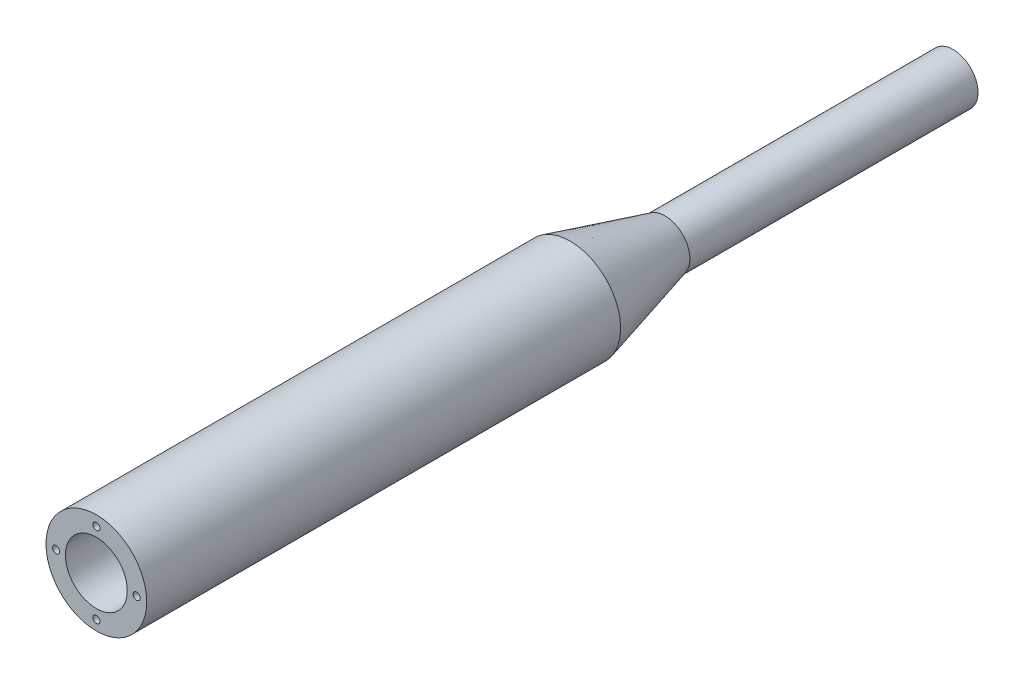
ISO-10303-21;
HEADER;
FILE_DESCRIPTION(('STEP AP214'),'2;1');
FILE_NAME('part.step','',(''),(''),'','','');
FILE_SCHEMA(('AUTOMOTIVE_DESIGN { 1 0 10303 214 1 1 1 1 }'));
ENDSEC;
DATA;
#1=APPLICATION_CONTEXT('core data for automotive mechanical design processes');
#2=APPLICATION_PROTOCOL_DEFINITION('international standard','automotive_design',2000,#1);
#3=PRODUCT_CONTEXT('',#1,'mechanical');
#4=PRODUCT('Part','Part','',(#3));
#5=PRODUCT_RELATED_PRODUCT_CATEGORY('part','',(#4));
#6=PRODUCT_DEFINITION_FORMATION('','',#4);
#7=PRODUCT_DEFINITION_CONTEXT('part definition',#1,'design');
#8=PRODUCT_DEFINITION('design','',#6,#7);
#9=PRODUCT_DEFINITION_SHAPE('','',#8);
#10=(LENGTH_UNIT() NAMED_UNIT(*) SI_UNIT(.MILLI.,.METRE.));
#11=(NAMED_UNIT(*) PLANE_ANGLE_UNIT() SI_UNIT($,.RADIAN.));
#12=(NAMED_UNIT(*) SI_UNIT($,.STERADIAN.) SOLID_ANGLE_UNIT());
#13=UNCERTAINTY_MEASURE_WITH_UNIT(LENGTH_MEASURE(1.E-05),#10,'distance_accuracy_value','');
#14=(GEOMETRIC_REPRESENTATION_CONTEXT(3) GLOBAL_UNCERTAINTY_ASSIGNED_CONTEXT((#13)) GLOBAL_UNIT_ASSIGNED_CONTEXT((#10,
#11,#12)) REPRESENTATION_CONTEXT('',''));
#15=CARTESIAN_POINT('',(0.,0.,0.));
#16=DIRECTION('',(0.,0.,1.));
#17=DIRECTION('',(1.,0.,0.));
#18=AXIS2_PLACEMENT_3D('',#15,#16,#17);
#19=CARTESIAN_POINT('',(0.,0.,254.));
#20=DIRECTION('',(0.,0.,1.));
#21=DIRECTION('',(1.,0.,0.));
#22=AXIS2_PLACEMENT_3D('',#19,#20,#21);
#23=CYLINDRICAL_SURFACE('',#22,15.875);
#24=CARTESIAN_POINT('',(0.,0.,0.));
#25=DIRECTION('',(0.,0.,1.));
#26=DIRECTION('',(1.,0.,0.));
#27=AXIS2_PLACEMENT_3D('',#24,#25,#26);
#28=CIRCLE('',#27,15.875);
#29=CARTESIAN_POINT('',(15.875,0.,0.));
#30=VERTEX_POINT('',#29);
#31=EDGE_CURVE('E98',#30,#30,#28,.T.);
#32=ORIENTED_EDGE('',*,*,#31,.F.);
#33=EDGE_LOOP('',(#32));
#34=FACE_BOUND('',#33,.T.);
#35=CARTESIAN_POINT('',(0.,0.,228.6));
#36=DIRECTION('',(0.,0.,1.));
#37=DIRECTION('',(1.,0.,0.));
#38=AXIS2_PLACEMENT_3D('',#35,#36,#37);
#39=CIRCLE('',#38,15.875);
#40=CARTESIAN_POINT('',(15.875,0.,228.6));
#41=VERTEX_POINT('',#40);
#42=EDGE_CURVE('E40',#41,#41,#39,.F.);
#43=ORIENTED_EDGE('',*,*,#42,.F.);
#44=EDGE_LOOP('',(#43));
#45=FACE_BOUND('',#44,.T.);
#46=ADVANCED_FACE('F36',(#34,#45),#23,.F.);
#47=CARTESIAN_POINT('',(0.,0.,254.));
#48=DIRECTION('',(0.,0.,-1.));
#49=DIRECTION('',(-1.,0.,0.));
#50=AXIS2_PLACEMENT_3D('',#47,#48,#49);
#51=CYLINDRICAL_SURFACE('',#50,26.9875);
#52=CARTESIAN_POINT('',(0.,0.,254.));
#53=DIRECTION('',(0.,0.,1.));
#54=DIRECTION('',(1.,0.,0.));
#55=AXIS2_PLACEMENT_3D('',#52,#53,#54);
#56=CIRCLE('',#55,26.9875);
#57=CARTESIAN_POINT('',(26.9875,0.,254.));
#58=VERTEX_POINT('',#57);
#59=EDGE_CURVE('E11',#58,#58,#56,.T.);
#60=ORIENTED_EDGE('',*,*,#59,.F.);
#61=EDGE_LOOP('',(#60));
#62=FACE_BOUND('',#61,.T.);
#63=CARTESIAN_POINT('',(0.,0.,0.));
#64=DIRECTION('',(0.,0.,-1.));
#65=DIRECTION('',(-1.,0.,0.));
#66=AXIS2_PLACEMENT_3D('',#63,#64,#65);
#67=CIRCLE('',#66,26.9875);
#68=CARTESIAN_POINT('',(-26.9875,0.,0.));
#69=VERTEX_POINT('',#68);
#70=EDGE_CURVE('E108',#69,#69,#67,.T.);
#71=ORIENTED_EDGE('',*,*,#70,.F.);
#72=EDGE_LOOP('',(#71));
#73=FACE_BOUND('',#72,.T.);
#74=ADVANCED_FACE('F38',(#62,#73),#51,.T.);
#75=CARTESIAN_POINT('',(0.,0.,254.));
#76=DIRECTION('',(0.,0.,1.));
#77=DIRECTION('',(1.,0.,0.));
#78=AXIS2_PLACEMENT_3D('',#75,#76,#77);
#79=PLANE('',#78);
#80=CARTESIAN_POINT('',(0.,21.59,254.));
#81=DIRECTION('',(0.,0.,1.));
#82=DIRECTION('',(1.,0.,0.));
#83=AXIS2_PLACEMENT_3D('',#80,#81,#82);
#84=CIRCLE('',#83,1.89865);
#85=CARTESIAN_POINT('',(1.89865,21.59,254.));
#86=VERTEX_POINT('',#85);
#87=EDGE_CURVE('E70',#86,#86,#84,.T.);
#88=ORIENTED_EDGE('',*,*,#87,.F.);
#89=EDGE_LOOP('',(#88));
#90=FACE_BOUND('',#89,.T.);
#91=CARTESIAN_POINT('',(-21.59,0.,254.));
#92=DIRECTION('',(0.,0.,1.));
#93=DIRECTION('',(1.,0.,0.));
#94=AXIS2_PLACEMENT_3D('',#91,#92,#93);
#95=CIRCLE('',#94,1.89864999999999);
#96=CARTESIAN_POINT('',(-19.69135,0.,254.));
#97=VERTEX_POINT('',#96);
#98=EDGE_CURVE('E69',#97,#97,#95,.T.);
#99=ORIENTED_EDGE('',*,*,#98,.F.);
#100=EDGE_LOOP('',(#99));
#101=FACE_BOUND('',#100,.T.);
#102=CARTESIAN_POINT('',(0.,-21.59,254.));
#103=DIRECTION('',(0.,0.,1.));
#104=DIRECTION('',(1.,0.,0.));
#105=AXIS2_PLACEMENT_3D('',#102,#103,#104);
#106=CIRCLE('',#105,1.89865);
#107=CARTESIAN_POINT('',(1.89865,-21.59,254.));
#108=VERTEX_POINT('',#107);
#109=EDGE_CURVE('E80',#108,#108,#106,.T.);
#110=ORIENTED_EDGE('',*,*,#109,.F.);
#111=EDGE_LOOP('',(#110));
#112=FACE_BOUND('',#111,.T.);
#113=CARTESIAN_POINT('',(21.59,0.,254.));
#114=DIRECTION('',(0.,0.,1.));
#115=DIRECTION('',(1.,0.,0.));
#116=AXIS2_PLACEMENT_3D('',#113,#114,#115);
#117=CIRCLE('',#116,1.89864999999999);
#118=CARTESIAN_POINT('',(23.48865,0.,254.));
#119=VERTEX_POINT('',#118);
#120=EDGE_CURVE('E86',#119,#119,#117,.T.);
#121=ORIENTED_EDGE('',*,*,#120,.F.);
#122=EDGE_LOOP('',(#121));
#123=FACE_BOUND('',#122,.T.);
#124=CARTESIAN_POINT('',(0.,0.,254.));
#125=DIRECTION('',(0.,0.,1.));
#126=DIRECTION('',(1.,0.,0.));
#127=AXIS2_PLACEMENT_3D('',#124,#125,#126);
#128=CIRCLE('',#127,16.5735);
#129=CARTESIAN_POINT('',(16.5735,0.,254.));
#130=VERTEX_POINT('',#129);
#131=EDGE_CURVE('E92',#130,#130,#128,.T.);
#132=ORIENTED_EDGE('',*,*,#131,.F.);
#133=EDGE_LOOP('',(#132));
#134=FACE_BOUND('',#133,.T.);
#135=ORIENTED_EDGE('',*,*,#59,.T.);
#136=EDGE_LOOP('',(#135));
#137=FACE_BOUND('',#136,.T.);
#138=ADVANCED_FACE('F136',(#90,#101,#112,#123,#134,#137),#79,.T.);
#139=CARTESIAN_POINT('',(0.,0.,-50.8));
#140=DIRECTION('',(0.,0.,1.));
#141=DIRECTION('',(1.,0.,0.));
#142=AXIS2_PLACEMENT_3D('',#139,#140,#141);
#143=CONICAL_SURFACE('',#142,13.335,0.262546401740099);
#144=ORIENTED_EDGE('',*,*,#70,.T.);
#145=EDGE_LOOP('',(#144));
#146=FACE_BOUND('',#145,.T.);
#147=CARTESIAN_POINT('',(0.,0.,-50.8));
#148=DIRECTION('',(0.,0.,-1.));
#149=DIRECTION('',(-1.,0.,0.));
#150=AXIS2_PLACEMENT_3D('',#147,#148,#149);
#151=CIRCLE('',#150,13.335);
#152=CARTESIAN_POINT('',(-13.335,0.,-50.8));
#153=VERTEX_POINT('',#152);
#154=EDGE_CURVE('E45',#153,#153,#151,.T.);
#155=ORIENTED_EDGE('',*,*,#154,.F.);
#156=EDGE_LOOP('',(#155));
#157=FACE_BOUND('',#156,.T.);
#158=ADVANCED_FACE('F127',(#146,#157),#143,.T.);
#159=CARTESIAN_POINT('',(0.,0.,-205.232));
#160=DIRECTION('',(0.,0.,-1.));
#161=DIRECTION('',(-1.,0.,0.));
#162=AXIS2_PLACEMENT_3D('',#159,#160,#161);
#163=PLANE('',#162);
#164=CARTESIAN_POINT('',(0.,0.,-205.232));
#165=DIRECTION('',(0.,0.,-1.));
#166=DIRECTION('',(-1.,0.,0.));
#167=AXIS2_PLACEMENT_3D('',#164,#165,#166);
#168=CIRCLE('',#167,13.335);
#169=CARTESIAN_POINT('',(-13.335,0.,-205.232));
#170=VERTEX_POINT('',#169);
#171=EDGE_CURVE('E105',#170,#170,#168,.T.);
#172=ORIENTED_EDGE('',*,*,#171,.T.);
#173=EDGE_LOOP('',(#172));
#174=FACE_BOUND('',#173,.T.);
#175=CARTESIAN_POINT('',(0.,0.,-205.232));
#176=DIRECTION('',(0.,0.,-1.));
#177=DIRECTION('',(-1.,0.,0.));
#178=AXIS2_PLACEMENT_3D('',#175,#176,#177);
#179=CIRCLE('',#178,6.35);
#180=CARTESIAN_POINT('',(-6.35,0.,-205.232));
#181=VERTEX_POINT('',#180);
#182=EDGE_CURVE('E102',#181,#181,#179,.T.);
#183=ORIENTED_EDGE('',*,*,#182,.F.);
#184=EDGE_LOOP('',(#183));
#185=FACE_BOUND('',#184,.T.);
#186=ADVANCED_FACE('F125',(#174,#185),#163,.T.);
#187=CARTESIAN_POINT('',(0.,0.,-205.232));
#188=DIRECTION('',(0.,0.,1.));
#189=DIRECTION('',(1.,0.,0.));
#190=AXIS2_PLACEMENT_3D('',#187,#188,#189);
#191=CYLINDRICAL_SURFACE('',#190,13.335);
#192=ORIENTED_EDGE('',*,*,#154,.T.);
#193=EDGE_LOOP('',(#192));
#194=FACE_BOUND('',#193,.T.);
#195=ORIENTED_EDGE('',*,*,#171,.F.);
#196=EDGE_LOOP('',(#195));
#197=FACE_BOUND('',#196,.T.);
#198=ADVANCED_FACE('F121',(#194,#197),#191,.T.);
#199=CARTESIAN_POINT('',(0.,0.,-205.232));
#200=DIRECTION('',(0.,0.,1.));
#201=DIRECTION('',(1.,0.,0.));
#202=AXIS2_PLACEMENT_3D('',#199,#200,#201);
#203=CYLINDRICAL_SURFACE('',#202,6.35);
#204=CARTESIAN_POINT('',(0.,0.,-5.72319739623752));
#205=DIRECTION('',(0.,0.,1.));
#206=DIRECTION('',(1.,0.,0.));
#207=AXIS2_PLACEMENT_3D('',#204,#205,#206);
#208=CIRCLE('',#207,6.35);
#209=CARTESIAN_POINT('',(6.35,0.,-5.72319739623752));
#210=VERTEX_POINT('',#209);
#211=EDGE_CURVE('E101',#210,#210,#208,.F.);
#212=ORIENTED_EDGE('',*,*,#211,.F.);
#213=EDGE_LOOP('',(#212));
#214=FACE_BOUND('',#213,.T.);
#215=ORIENTED_EDGE('',*,*,#182,.T.);
#216=EDGE_LOOP('',(#215));
#217=FACE_BOUND('',#216,.T.);
#218=ADVANCED_FACE('F118',(#214,#217),#203,.F.);
#219=CARTESIAN_POINT('',(0.,0.,0.));
#220=DIRECTION('',(0.,0.,1.));
#221=DIRECTION('',(1.,0.,0.));
#222=AXIS2_PLACEMENT_3D('',#219,#220,#221);
#223=CONICAL_SURFACE('',#222,15.875,1.02974425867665);
#224=ORIENTED_EDGE('',*,*,#211,.T.);
#225=EDGE_LOOP('',(#224));
#226=FACE_BOUND('',#225,.T.);
#227=ORIENTED_EDGE('',*,*,#31,.T.);
#228=EDGE_LOOP('',(#227));
#229=FACE_BOUND('',#228,.T.);
#230=ADVANCED_FACE('F115',(#226,#229),#223,.F.);
#231=CARTESIAN_POINT('',(0.,0.,228.6));
#232=DIRECTION('',(0.,0.,1.));
#233=DIRECTION('',(1.,0.,0.));
#234=AXIS2_PLACEMENT_3D('',#231,#232,#233);
#235=PLANE('',#234);
#236=CARTESIAN_POINT('',(0.,0.,228.6));
#237=DIRECTION('',(0.,0.,1.));
#238=DIRECTION('',(1.,0.,0.));
#239=AXIS2_PLACEMENT_3D('',#236,#237,#238);
#240=CIRCLE('',#239,16.5735);
#241=CARTESIAN_POINT('',(16.5735,0.,228.6));
#242=VERTEX_POINT('',#241);
#243=EDGE_CURVE('E93',#242,#242,#240,.T.);
#244=ORIENTED_EDGE('',*,*,#243,.T.);
#245=EDGE_LOOP('',(#244));
#246=FACE_BOUND('',#245,.T.);
#247=ORIENTED_EDGE('',*,*,#42,.T.);
#248=EDGE_LOOP('',(#247));
#249=FACE_BOUND('',#248,.T.);
#250=ADVANCED_FACE('F153',(#246,#249),#235,.T.);
#251=CARTESIAN_POINT('',(0.,0.,228.6));
#252=DIRECTION('',(0.,0.,1.));
#253=DIRECTION('',(1.,0.,0.));
#254=AXIS2_PLACEMENT_3D('',#251,#252,#253);
#255=CYLINDRICAL_SURFACE('',#254,16.5735);
#256=ORIENTED_EDGE('',*,*,#243,.F.);
#257=EDGE_LOOP('',(#256));
#258=FACE_BOUND('',#257,.T.);
#259=ORIENTED_EDGE('',*,*,#131,.T.);
#260=EDGE_LOOP('',(#259));
#261=FACE_BOUND('',#260,.T.);
#262=ADVANCED_FACE('F150',(#258,#261),#255,.F.);
#263=CARTESIAN_POINT('',(21.59,0.,228.6));
#264=DIRECTION('',(0.,0.,1.));
#265=DIRECTION('',(1.,0.,0.));
#266=AXIS2_PLACEMENT_3D('',#263,#264,#265);
#267=CONICAL_SURFACE('',#266,1.89864999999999,1.02974425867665);
#268=CARTESIAN_POINT('',(21.59,0.,227.459175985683));
#269=VERTEX_POINT('',#268);
#270=VERTEX_LOOP('',#269);
#271=FACE_BOUND('',#270,.T.);
#272=CARTESIAN_POINT('',(21.59,0.,228.6));
#273=DIRECTION('',(0.,0.,1.));
#274=DIRECTION('',(1.,0.,0.));
#275=AXIS2_PLACEMENT_3D('',#272,#273,#274);
#276=CIRCLE('',#275,1.89864999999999);
#277=CARTESIAN_POINT('',(23.48865,0.,228.6));
#278=VERTEX_POINT('',#277);
#279=EDGE_CURVE('E89',#278,#278,#276,.T.);
#280=ORIENTED_EDGE('',*,*,#279,.T.);
#281=EDGE_LOOP('',(#280));
#282=FACE_BOUND('',#281,.T.);
#283=ADVANCED_FACE('F161',(#271,#282),#267,.F.);
#284=CARTESIAN_POINT('',(21.59,0.,254.));
#285=DIRECTION('',(0.,0.,1.));
#286=DIRECTION('',(1.,0.,0.));
#287=AXIS2_PLACEMENT_3D('',#284,#285,#286);
#288=CYLINDRICAL_SURFACE('',#287,1.89864999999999);
#289=ORIENTED_EDGE('',*,*,#279,.F.);
#290=EDGE_LOOP('',(#289));
#291=FACE_BOUND('',#290,.T.);
#292=ORIENTED_EDGE('',*,*,#120,.T.);
#293=EDGE_LOOP('',(#292));
#294=FACE_BOUND('',#293,.T.);
#295=ADVANCED_FACE('F167',(#291,#294),#288,.F.);
#296=CARTESIAN_POINT('',(0.,-21.59,228.6));
#297=DIRECTION('',(0.,0.,1.));
#298=DIRECTION('',(1.,0.,0.));
#299=AXIS2_PLACEMENT_3D('',#296,#297,#298);
#300=CONICAL_SURFACE('',#299,1.89864999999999,1.02974425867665);
#301=CARTESIAN_POINT('',(0.,-21.59,227.459175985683));
#302=VERTEX_POINT('',#301);
#303=VERTEX_LOOP('',#302);
#304=FACE_BOUND('',#303,.T.);
#305=CARTESIAN_POINT('',(0.,-21.59,228.6));
#306=DIRECTION('',(0.,0.,1.));
#307=DIRECTION('',(1.,0.,0.));
#308=AXIS2_PLACEMENT_3D('',#305,#306,#307);
#309=CIRCLE('',#308,1.89864999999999);
#310=CARTESIAN_POINT('',(1.89864999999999,-21.59,228.6));
#311=VERTEX_POINT('',#310);
#312=EDGE_CURVE('E83',#311,#311,#309,.T.);
#313=ORIENTED_EDGE('',*,*,#312,.T.);
#314=EDGE_LOOP('',(#313));
#315=FACE_BOUND('',#314,.T.);
#316=ADVANCED_FACE('F170',(#304,#315),#300,.F.);
#317=CARTESIAN_POINT('',(0.,-21.59,254.));
#318=DIRECTION('',(0.,0.,1.));
#319=DIRECTION('',(1.,0.,0.));
#320=AXIS2_PLACEMENT_3D('',#317,#318,#319);
#321=CYLINDRICAL_SURFACE('',#320,1.89865);
#322=ORIENTED_EDGE('',*,*,#312,.F.);
#323=EDGE_LOOP('',(#322));
#324=FACE_BOUND('',#323,.T.);
#325=ORIENTED_EDGE('',*,*,#109,.T.);
#326=EDGE_LOOP('',(#325));
#327=FACE_BOUND('',#326,.T.);
#328=ADVANCED_FACE('F174',(#324,#327),#321,.F.);
#329=CARTESIAN_POINT('',(-21.59,0.,228.6));
#330=DIRECTION('',(0.,0.,1.));
#331=DIRECTION('',(1.,0.,0.));
#332=AXIS2_PLACEMENT_3D('',#329,#330,#331);
#333=CONICAL_SURFACE('',#332,1.89864999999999,1.02974425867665);
#334=CARTESIAN_POINT('',(-21.59,0.,227.459175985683));
#335=VERTEX_POINT('',#334);
#336=VERTEX_LOOP('',#335);
#337=FACE_BOUND('',#336,.T.);
#338=CARTESIAN_POINT('',(-21.59,0.,228.6));
#339=DIRECTION('',(0.,0.,1.));
#340=DIRECTION('',(1.,0.,0.));
#341=AXIS2_PLACEMENT_3D('',#338,#339,#340);
#342=CIRCLE('',#341,1.89864999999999);
#343=CARTESIAN_POINT('',(-19.69135,0.,228.6));
#344=VERTEX_POINT('',#343);
#345=EDGE_CURVE('E73',#344,#344,#342,.T.);
#346=ORIENTED_EDGE('',*,*,#345,.T.);
#347=EDGE_LOOP('',(#346));
#348=FACE_BOUND('',#347,.T.);
#349=ADVANCED_FACE('F177',(#337,#348),#333,.F.);
#350=CARTESIAN_POINT('',(-21.59,0.,254.));
#351=DIRECTION('',(0.,0.,1.));
#352=DIRECTION('',(1.,0.,0.));
#353=AXIS2_PLACEMENT_3D('',#350,#351,#352);
#354=CYLINDRICAL_SURFACE('',#353,1.89864999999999);
#355=ORIENTED_EDGE('',*,*,#345,.F.);
#356=EDGE_LOOP('',(#355));
#357=FACE_BOUND('',#356,.T.);
#358=ORIENTED_EDGE('',*,*,#98,.T.);
#359=EDGE_LOOP('',(#358));
#360=FACE_BOUND('',#359,.T.);
#361=ADVANCED_FACE('F63',(#357,#360),#354,.F.);
#362=CARTESIAN_POINT('',(0.,21.59,228.6));
#363=DIRECTION('',(0.,0.,1.));
#364=DIRECTION('',(1.,0.,0.));
#365=AXIS2_PLACEMENT_3D('',#362,#363,#364);
#366=CONICAL_SURFACE('',#365,1.89864999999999,1.02974425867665);
#367=CARTESIAN_POINT('',(0.,21.59,227.459175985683));
#368=VERTEX_POINT('',#367);
#369=VERTEX_LOOP('',#368);
#370=FACE_BOUND('',#369,.T.);
#371=CARTESIAN_POINT('',(0.,21.59,228.6));
#372=DIRECTION('',(0.,0.,1.));
#373=DIRECTION('',(1.,0.,0.));
#374=AXIS2_PLACEMENT_3D('',#371,#372,#373);
#375=CIRCLE('',#374,1.89864999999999);
#376=CARTESIAN_POINT('',(1.89864999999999,21.59,228.6));
#377=VERTEX_POINT('',#376);
#378=EDGE_CURVE('E67',#377,#377,#375,.T.);
#379=ORIENTED_EDGE('',*,*,#378,.T.);
#380=EDGE_LOOP('',(#379));
#381=FACE_BOUND('',#380,.T.);
#382=ADVANCED_FACE('F59',(#370,#381),#366,.F.);
#383=CARTESIAN_POINT('',(0.,21.59,254.));
#384=DIRECTION('',(0.,0.,1.));
#385=DIRECTION('',(1.,0.,0.));
#386=AXIS2_PLACEMENT_3D('',#383,#384,#385);
#387=CYLINDRICAL_SURFACE('',#386,1.89865);
#388=ORIENTED_EDGE('',*,*,#378,.F.);
#389=EDGE_LOOP('',(#388));
#390=FACE_BOUND('',#389,.T.);
#391=ORIENTED_EDGE('',*,*,#87,.T.);
#392=EDGE_LOOP('',(#391));
#393=FACE_BOUND('',#392,.T.);
#394=ADVANCED_FACE('F62',(#390,#393),#387,.F.);
#395=CLOSED_SHELL('',(#46,#74,#138,#158,#186,#198,#218,#230,#250,#262,#283,#295,#316,#328,#349,
#361,#382,#394));
#396=MANIFOLD_SOLID_BREP('B2',#395);
#397=ADVANCED_BREP_SHAPE_REPRESENTATION('',(#18,#396),#14);
#398=SHAPE_DEFINITION_REPRESENTATION(#9,#397);
ENDSEC;
END-ISO-10303-21;
